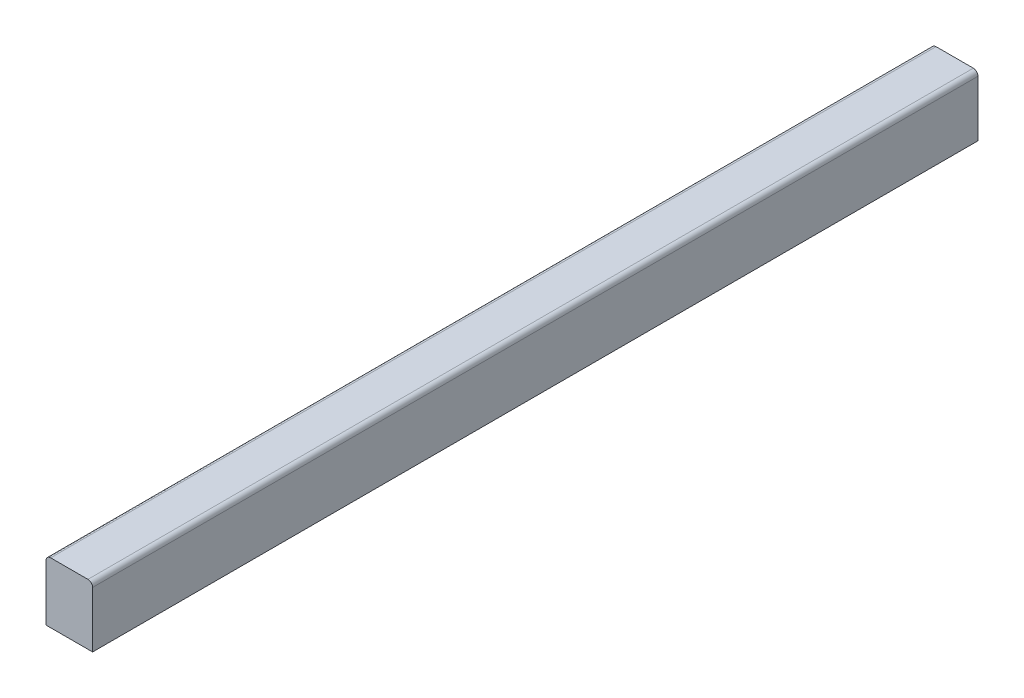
ISO-10303-21;
HEADER;
FILE_DESCRIPTION(('STEP AP214'),'2;1');
FILE_NAME('part.step','',(''),(''),'','','');
FILE_SCHEMA(('AUTOMOTIVE_DESIGN { 1 0 10303 214 1 1 1 1 }'));
ENDSEC;
DATA;
#1=APPLICATION_CONTEXT('core data for automotive mechanical design processes');
#2=APPLICATION_PROTOCOL_DEFINITION('international standard','automotive_design',2000,#1);
#3=PRODUCT_CONTEXT('',#1,'mechanical');
#4=PRODUCT('Part','Part','',(#3));
#5=PRODUCT_RELATED_PRODUCT_CATEGORY('part','',(#4));
#6=PRODUCT_DEFINITION_FORMATION('','',#4);
#7=PRODUCT_DEFINITION_CONTEXT('part definition',#1,'design');
#8=PRODUCT_DEFINITION('design','',#6,#7);
#9=PRODUCT_DEFINITION_SHAPE('','',#8);
#10=(LENGTH_UNIT() NAMED_UNIT(*) SI_UNIT(.MILLI.,.METRE.));
#11=(NAMED_UNIT(*) PLANE_ANGLE_UNIT() SI_UNIT($,.RADIAN.));
#12=(NAMED_UNIT(*) SI_UNIT($,.STERADIAN.) SOLID_ANGLE_UNIT());
#13=UNCERTAINTY_MEASURE_WITH_UNIT(LENGTH_MEASURE(1.E-05),#10,'distance_accuracy_value','');
#14=(GEOMETRIC_REPRESENTATION_CONTEXT(3) GLOBAL_UNCERTAINTY_ASSIGNED_CONTEXT((#13)) GLOBAL_UNIT_ASSIGNED_CONTEXT((#10,
#11,#12)) REPRESENTATION_CONTEXT('',''));
#15=CARTESIAN_POINT('',(0.,0.,0.));
#16=DIRECTION('',(0.,0.,1.));
#17=DIRECTION('',(1.,0.,0.));
#18=AXIS2_PLACEMENT_3D('',#15,#16,#17);
#19=CARTESIAN_POINT('',(5.,-6.5,190.));
#20=DIRECTION('',(-1.,0.,0.));
#21=DIRECTION('',(0.,0.,1.));
#22=AXIS2_PLACEMENT_3D('',#19,#20,#21);
#23=PLANE('',#22);
#24=DIRECTION('',(0.,1.,0.));
#25=VECTOR('',#24,1.);
#26=CARTESIAN_POINT('',(5.,-6.5,0.));
#27=LINE('',#26,#25);
#28=CARTESIAN_POINT('',(5.,-6.5,0.));
#29=VERTEX_POINT('',#28);
#30=CARTESIAN_POINT('',(5.,5.5,0.));
#31=VERTEX_POINT('',#30);
#32=EDGE_CURVE('E115',#29,#31,#27,.T.);
#33=ORIENTED_EDGE('',*,*,#32,.T.);
#34=DIRECTION('',(0.,0.,-1.));
#35=VECTOR('',#34,1.);
#36=CARTESIAN_POINT('',(5.,5.5,190.));
#37=LINE('',#36,#35);
#38=CARTESIAN_POINT('',(5.,5.5,190.));
#39=VERTEX_POINT('',#38);
#40=EDGE_CURVE('E11',#31,#39,#37,.F.);
#41=ORIENTED_EDGE('',*,*,#40,.T.);
#42=DIRECTION('',(0.,1.,0.));
#43=VECTOR('',#42,1.);
#44=CARTESIAN_POINT('',(5.,-6.5,190.));
#45=LINE('',#44,#43);
#46=CARTESIAN_POINT('',(5.,-6.5,190.));
#47=VERTEX_POINT('',#46);
#48=EDGE_CURVE('E121',#47,#39,#45,.T.);
#49=ORIENTED_EDGE('',*,*,#48,.F.);
#50=DIRECTION('',(0.,0.,-1.));
#51=VECTOR('',#50,1.);
#52=CARTESIAN_POINT('',(5.,-6.5,190.));
#53=LINE('',#52,#51);
#54=EDGE_CURVE('E107',#47,#29,#53,.T.);
#55=ORIENTED_EDGE('',*,*,#54,.T.);
#56=EDGE_LOOP('',(#33,#41,#49,#55));
#57=FACE_BOUND('',#56,.T.);
#58=ADVANCED_FACE('F33',(#57),#23,.F.);
#59=CARTESIAN_POINT('',(-5.,6.5,190.));
#60=DIRECTION('',(0.,-1.,0.));
#61=DIRECTION('',(0.,0.,-1.));
#62=AXIS2_PLACEMENT_3D('',#59,#60,#61);
#63=PLANE('',#62);
#64=DIRECTION('',(-1.,0.,0.));
#65=VECTOR('',#64,1.);
#66=CARTESIAN_POINT('',(-5.,6.5,0.));
#67=LINE('',#66,#65);
#68=CARTESIAN_POINT('',(4.,6.5,0.));
#69=VERTEX_POINT('',#68);
#70=CARTESIAN_POINT('',(-4.,6.5,0.));
#71=VERTEX_POINT('',#70);
#72=EDGE_CURVE('E117',#69,#71,#67,.T.);
#73=ORIENTED_EDGE('',*,*,#72,.T.);
#74=DIRECTION('',(0.,0.,-1.));
#75=VECTOR('',#74,1.);
#76=CARTESIAN_POINT('',(-4.,6.5,190.));
#77=LINE('',#76,#75);
#78=CARTESIAN_POINT('',(-4.,6.5,190.));
#79=VERTEX_POINT('',#78);
#80=EDGE_CURVE('E54',#71,#79,#77,.F.);
#81=ORIENTED_EDGE('',*,*,#80,.T.);
#82=DIRECTION('',(-1.,0.,0.));
#83=VECTOR('',#82,1.);
#84=CARTESIAN_POINT('',(-5.,6.5,190.));
#85=LINE('',#84,#83);
#86=CARTESIAN_POINT('',(4.,6.5,190.));
#87=VERTEX_POINT('',#86);
#88=EDGE_CURVE('E97',#87,#79,#85,.T.);
#89=ORIENTED_EDGE('',*,*,#88,.F.);
#90=DIRECTION('',(0.,0.,-1.));
#91=VECTOR('',#90,1.);
#92=CARTESIAN_POINT('',(4.,6.5,190.));
#93=LINE('',#92,#91);
#94=EDGE_CURVE('E128',#87,#69,#93,.T.);
#95=ORIENTED_EDGE('',*,*,#94,.T.);
#96=EDGE_LOOP('',(#73,#81,#89,#95));
#97=FACE_BOUND('',#96,.T.);
#98=ADVANCED_FACE('F136',(#97),#63,.F.);
#99=CARTESIAN_POINT('',(-5.,-6.5,190.));
#100=DIRECTION('',(1.,0.,0.));
#101=DIRECTION('',(0.,0.,-1.));
#102=AXIS2_PLACEMENT_3D('',#99,#100,#101);
#103=PLANE('',#102);
#104=DIRECTION('',(0.,-1.,0.));
#105=VECTOR('',#104,1.);
#106=CARTESIAN_POINT('',(-5.,-6.5,190.));
#107=LINE('',#106,#105);
#108=CARTESIAN_POINT('',(-5.,5.5,190.));
#109=VERTEX_POINT('',#108);
#110=CARTESIAN_POINT('',(-5.,-6.5,190.));
#111=VERTEX_POINT('',#110);
#112=EDGE_CURVE('E87',#109,#111,#107,.T.);
#113=ORIENTED_EDGE('',*,*,#112,.F.);
#114=DIRECTION('',(0.,0.,-1.));
#115=VECTOR('',#114,1.);
#116=CARTESIAN_POINT('',(-5.,5.5,190.));
#117=LINE('',#116,#115);
#118=CARTESIAN_POINT('',(-5.,5.5,0.));
#119=VERTEX_POINT('',#118);
#120=EDGE_CURVE('E106',#109,#119,#117,.T.);
#121=ORIENTED_EDGE('',*,*,#120,.T.);
#122=DIRECTION('',(0.,-1.,0.));
#123=VECTOR('',#122,1.);
#124=CARTESIAN_POINT('',(-5.,-6.5,0.));
#125=LINE('',#124,#123);
#126=CARTESIAN_POINT('',(-5.,-6.5,0.));
#127=VERTEX_POINT('',#126);
#128=EDGE_CURVE('E103',#119,#127,#125,.T.);
#129=ORIENTED_EDGE('',*,*,#128,.T.);
#130=DIRECTION('',(0.,0.,-1.));
#131=VECTOR('',#130,1.);
#132=CARTESIAN_POINT('',(-5.,-6.5,190.));
#133=LINE('',#132,#131);
#134=EDGE_CURVE('E100',#111,#127,#133,.T.);
#135=ORIENTED_EDGE('',*,*,#134,.F.);
#136=EDGE_LOOP('',(#113,#121,#129,#135));
#137=FACE_BOUND('',#136,.T.);
#138=ADVANCED_FACE('F101',(#137),#103,.F.);
#139=CARTESIAN_POINT('',(-5.,-6.5,190.));
#140=DIRECTION('',(0.,1.,0.));
#141=DIRECTION('',(0.,0.,1.));
#142=AXIS2_PLACEMENT_3D('',#139,#140,#141);
#143=PLANE('',#142);
#144=DIRECTION('',(1.,0.,0.));
#145=VECTOR('',#144,1.);
#146=CARTESIAN_POINT('',(-5.,-6.5,0.));
#147=LINE('',#146,#145);
#148=EDGE_CURVE('E120',#127,#29,#147,.T.);
#149=ORIENTED_EDGE('',*,*,#148,.T.);
#150=ORIENTED_EDGE('',*,*,#54,.F.);
#151=DIRECTION('',(1.,0.,0.));
#152=VECTOR('',#151,1.);
#153=CARTESIAN_POINT('',(-5.,-6.5,190.));
#154=LINE('',#153,#152);
#155=EDGE_CURVE('E91',#111,#47,#154,.T.);
#156=ORIENTED_EDGE('',*,*,#155,.F.);
#157=ORIENTED_EDGE('',*,*,#134,.T.);
#158=EDGE_LOOP('',(#149,#150,#156,#157));
#159=FACE_BOUND('',#158,.T.);
#160=ADVANCED_FACE('F109',(#159),#143,.F.);
#161=CARTESIAN_POINT('',(0.,0.,190.));
#162=DIRECTION('',(0.,0.,-1.));
#163=DIRECTION('',(-1.,0.,0.));
#164=AXIS2_PLACEMENT_3D('',#161,#162,#163);
#165=PLANE('',#164);
#166=ORIENTED_EDGE('',*,*,#88,.T.);
#167=CARTESIAN_POINT('',(-4.,5.5,190.));
#168=DIRECTION('',(0.,0.,-1.));
#169=DIRECTION('',(-1.,0.,0.));
#170=AXIS2_PLACEMENT_3D('',#167,#168,#169);
#171=CIRCLE('',#170,1.);
#172=EDGE_CURVE('E41',#79,#109,#171,.F.);
#173=ORIENTED_EDGE('',*,*,#172,.T.);
#174=ORIENTED_EDGE('',*,*,#112,.T.);
#175=ORIENTED_EDGE('',*,*,#155,.T.);
#176=ORIENTED_EDGE('',*,*,#48,.T.);
#177=CARTESIAN_POINT('',(4.,5.5,190.));
#178=DIRECTION('',(0.,0.,-1.));
#179=DIRECTION('',(-1.,0.,0.));
#180=AXIS2_PLACEMENT_3D('',#177,#178,#179);
#181=CIRCLE('',#180,1.);
#182=EDGE_CURVE('E132',#39,#87,#181,.F.);
#183=ORIENTED_EDGE('',*,*,#182,.T.);
#184=EDGE_LOOP('',(#166,#173,#174,#175,#176,#183));
#185=FACE_BOUND('',#184,.T.);
#186=ADVANCED_FACE('F89',(#185),#165,.F.);
#187=CARTESIAN_POINT('',(0.,0.,0.));
#188=DIRECTION('',(0.,0.,-1.));
#189=DIRECTION('',(-1.,0.,0.));
#190=AXIS2_PLACEMENT_3D('',#187,#188,#189);
#191=PLANE('',#190);
#192=ORIENTED_EDGE('',*,*,#128,.F.);
#193=CARTESIAN_POINT('',(-4.,5.5,0.));
#194=DIRECTION('',(0.,0.,-1.));
#195=DIRECTION('',(-1.,0.,0.));
#196=AXIS2_PLACEMENT_3D('',#193,#194,#195);
#197=CIRCLE('',#196,1.);
#198=EDGE_CURVE('E126',#119,#71,#197,.T.);
#199=ORIENTED_EDGE('',*,*,#198,.T.);
#200=ORIENTED_EDGE('',*,*,#72,.F.);
#201=CARTESIAN_POINT('',(4.,5.5,0.));
#202=DIRECTION('',(0.,0.,-1.));
#203=DIRECTION('',(-1.,0.,0.));
#204=AXIS2_PLACEMENT_3D('',#201,#202,#203);
#205=CIRCLE('',#204,1.);
#206=EDGE_CURVE('E124',#69,#31,#205,.T.);
#207=ORIENTED_EDGE('',*,*,#206,.T.);
#208=ORIENTED_EDGE('',*,*,#32,.F.);
#209=ORIENTED_EDGE('',*,*,#148,.F.);
#210=EDGE_LOOP('',(#192,#199,#200,#207,#208,#209));
#211=FACE_BOUND('',#210,.T.);
#212=ADVANCED_FACE('F140',(#211),#191,.T.);
#213=CARTESIAN_POINT('',(-4.,5.5,190.));
#214=DIRECTION('',(0.,0.,-1.));
#215=DIRECTION('',(-1.,0.,0.));
#216=AXIS2_PLACEMENT_3D('',#213,#214,#215);
#217=CYLINDRICAL_SURFACE('',#216,1.);
#218=ORIENTED_EDGE('',*,*,#172,.F.);
#219=ORIENTED_EDGE('',*,*,#80,.F.);
#220=ORIENTED_EDGE('',*,*,#198,.F.);
#221=ORIENTED_EDGE('',*,*,#120,.F.);
#222=EDGE_LOOP('',(#218,#219,#220,#221));
#223=FACE_BOUND('',#222,.T.);
#224=ADVANCED_FACE('F149',(#223),#217,.T.);
#225=CARTESIAN_POINT('',(4.,5.5,190.));
#226=DIRECTION('',(0.,0.,-1.));
#227=DIRECTION('',(-1.,0.,0.));
#228=AXIS2_PLACEMENT_3D('',#225,#226,#227);
#229=CYLINDRICAL_SURFACE('',#228,1.);
#230=ORIENTED_EDGE('',*,*,#182,.F.);
#231=ORIENTED_EDGE('',*,*,#40,.F.);
#232=ORIENTED_EDGE('',*,*,#206,.F.);
#233=ORIENTED_EDGE('',*,*,#94,.F.);
#234=EDGE_LOOP('',(#230,#231,#232,#233));
#235=FACE_BOUND('',#234,.T.);
#236=ADVANCED_FACE('F35',(#235),#229,.T.);
#237=CLOSED_SHELL('',(#58,#98,#138,#160,#186,#212,#224,#236));
#238=MANIFOLD_SOLID_BREP('B2',#237);
#239=ADVANCED_BREP_SHAPE_REPRESENTATION('',(#18,#238),#14);
#240=SHAPE_DEFINITION_REPRESENTATION(#9,#239);
ENDSEC;
END-ISO-10303-21;
